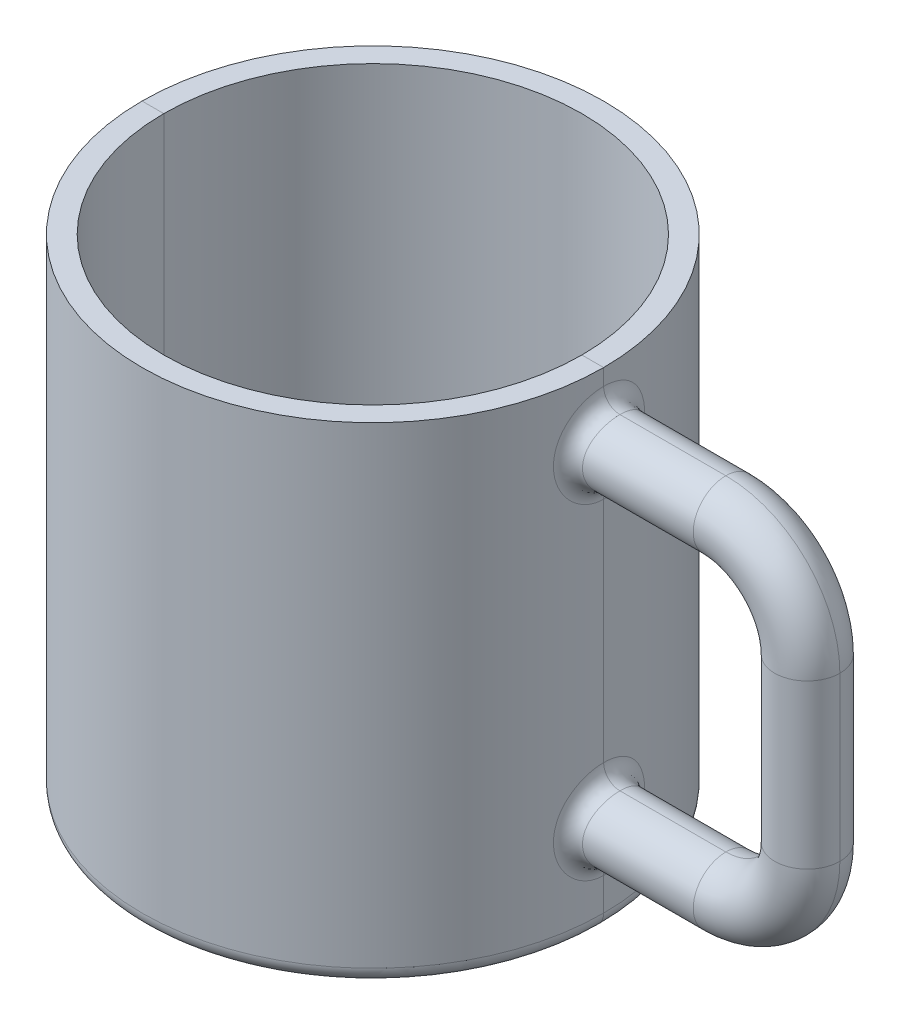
from build123d import *

# Parameters (mm, degrees)
SKETCH1_R           = 42.5
EXTRUDE1_DEPTH      = 90
FILLET1_R           = 3
SHELL1_T            = -4
FILLET2_R           = 3
SKETCH3_R           = 6
EXTRUDE5_REACH      = 141.329
EXTRUDE5_END_RADIUS = 42.5
SKETCH5_R           = 6
EXTRUDE6_REACH      = 141.329
SKETCH6_R           = 6
FILLET3_R           = 3


with BuildPart() as part:
    # Sketch1 → Extrude1 (new body)
    with BuildSketch(Plane(origin=(0, 0, 0), x_dir=(1, 0, 0), z_dir=(0, 1, 0))):
        with Locations(Location((0, 0, 0), (0, 0, 90))):
            Circle(SKETCH1_R)
    extrude(amount=EXTRUDE1_DEPTH)

    # Fillet1
    fillet1_edges = [part.edges().sort_by_distance(p)[0] for p in [
        (0, 0, 42.5),
    ]]
    fillet(fillet1_edges, radius=FILLET1_R)

    # Shell1
    shell1_openings = [part.faces().sort_by_distance(p)[0] for p in [
        (0, 90, 0),
    ]]
    offset(amount=SHELL1_T, openings=shell1_openings, kind=Kind.INTERSECTION)

    # Fillet2
    fillet2_edges = [part.edges().sort_by_distance(p)[0] for p in [
        (0, 4, 38.5),
    ]]
    fillet(fillet2_edges, radius=FILLET2_R)



with BuildPart() as body_2:
    # Sweep1: sweep along a path in Sketch2
    with BuildLine(Plane.XY) as sweep1_path:
        Line((55, 78), (65, 78))
        ThreePointArc((65, 78), (75.606601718, 73.606601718), (80, 63))
        Line((80, 63), (80, 33))
        ThreePointArc((80, 33), (75.606601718, 22.393398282), (65, 18))
        Line((65, 18), (55, 18))
    # Sketch3 → Sweep1 (sweep)
    with BuildSketch(Plane(origin=(55, 0, 0), x_dir=(0, 0, -1), z_dir=(1, 0, 0))):
        with Locations((0, 78)):
            Circle(SKETCH3_R)
    sweep(path=sweep1_path.line)


with BuildPart() as part_1:
    add(part.part)

    add(body_2.part)  # Extrude5 merges body 2
    # Extrude5: up to this cylinder (the profile starts outside it)
    extrude5_end = Plane(origin=(0, 78, 0), z_dir=(0, -1, 0)) * Cylinder(EXTRUDE5_END_RADIUS, 368.658, mode=Mode.PRIVATE)
    # Sketch5 → Extrude5 (add, up to the surface)
    with BuildSketch(Plane.ZY.offset(-55), mode=Mode.PRIVATE) as extrude5_sk1:
        with Locations(Location((0, 78, 0), (0, 0, 180))):
            Circle(SKETCH5_R)
    extrude5_tool1 = extrude(extrude5_sk1.sketch, amount=EXTRUDE5_REACH, mode=Mode.PRIVATE) - extrude5_end
    add(extrude5_tool1.solids().sort_by_distance((55, 78, 0))[0])

    # Sketch6 → Extrude6 (add, up to next)
    with BuildSketch(Plane.ZY.offset(-55), mode=Mode.PRIVATE) as extrude6_sk1:
        with Locations(Location((0, 18, 0), (0, 0, 270))):
            Circle(SKETCH6_R)
    extrude6_tool1 = extrude(extrude6_sk1.sketch, amount=EXTRUDE6_REACH, mode=Mode.PRIVATE) - part_1.part
    add(extrude6_tool1.solids().sort_by_distance((55, 18, 0))[0])

    # Fillet3
    fillet3_edges = [part_1.edges().sort_by_distance(p)[0] for p in [
        (42.074338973, 78, 6),
        (42.500000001, 23.999999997, -3e-09),
    ]]
    fillet(fillet3_edges, radius=FILLET3_R)


solid = part_1.part
